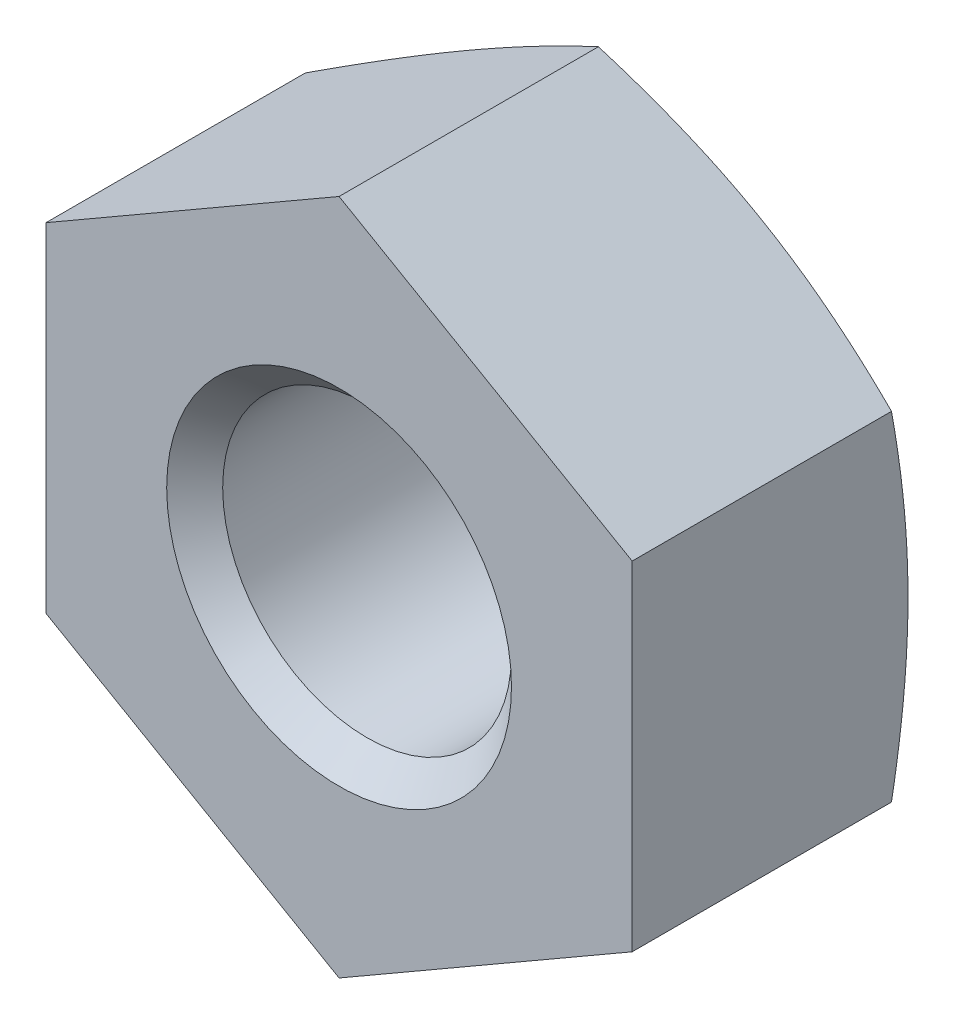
ISO-10303-21;
HEADER;
FILE_DESCRIPTION(('STEP AP214'),'2;1');
FILE_NAME('part.step','',(''),(''),'','','');
FILE_SCHEMA(('AUTOMOTIVE_DESIGN { 1 0 10303 214 1 1 1 1 }'));
ENDSEC;
DATA;
#1=APPLICATION_CONTEXT('core data for automotive mechanical design processes');
#2=APPLICATION_PROTOCOL_DEFINITION('international standard','automotive_design',2000,#1);
#3=PRODUCT_CONTEXT('',#1,'mechanical');
#4=PRODUCT('Part','Part','',(#3));
#5=PRODUCT_RELATED_PRODUCT_CATEGORY('part','',(#4));
#6=PRODUCT_DEFINITION_FORMATION('','',#4);
#7=PRODUCT_DEFINITION_CONTEXT('part definition',#1,'design');
#8=PRODUCT_DEFINITION('design','',#6,#7);
#9=PRODUCT_DEFINITION_SHAPE('','',#8);
#10=(LENGTH_UNIT() NAMED_UNIT(*) SI_UNIT(.MILLI.,.METRE.));
#11=(NAMED_UNIT(*) PLANE_ANGLE_UNIT() SI_UNIT($,.RADIAN.));
#12=(NAMED_UNIT(*) SI_UNIT($,.STERADIAN.) SOLID_ANGLE_UNIT());
#13=UNCERTAINTY_MEASURE_WITH_UNIT(LENGTH_MEASURE(1.E-05),#10,'distance_accuracy_value','');
#14=(GEOMETRIC_REPRESENTATION_CONTEXT(3) GLOBAL_UNCERTAINTY_ASSIGNED_CONTEXT((#13)) GLOBAL_UNIT_ASSIGNED_CONTEXT((#10,
#11,#12)) REPRESENTATION_CONTEXT('',''));
#15=CARTESIAN_POINT('',(0.,0.,0.));
#16=DIRECTION('',(0.,0.,1.));
#17=DIRECTION('',(1.,0.,0.));
#18=AXIS2_PLACEMENT_3D('',#15,#16,#17);
#19=CARTESIAN_POINT('',(0.,0.,0.));
#20=DIRECTION('',(0.,0.,1.));
#21=DIRECTION('',(1.,0.,0.));
#22=AXIS2_PLACEMENT_3D('',#19,#20,#21);
#23=PLANE('',#22);
#24=CARTESIAN_POINT('',(0.,0.,0.));
#25=DIRECTION('',(0.,0.,-1.));
#26=DIRECTION('',(-1.,0.,0.));
#27=AXIS2_PLACEMENT_3D('',#24,#25,#26);
#28=CIRCLE('',#27,4.99999999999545);
#29=CARTESIAN_POINT('',(-4.99999999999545,0.,0.));
#30=VERTEX_POINT('',#29);
#31=EDGE_CURVE('E19',#30,#30,#28,.F.);
#32=ORIENTED_EDGE('',*,*,#31,.T.);
#33=EDGE_LOOP('',(#32));
#34=FACE_BOUND('',#33,.T.);
#35=CARTESIAN_POINT('',(0.,0.,0.));
#36=DIRECTION('',(0.,0.,1.));
#37=DIRECTION('',(0.,-1.,0.));
#38=AXIS2_PLACEMENT_3D('',#35,#36,#37);
#39=CIRCLE('',#38,8.5);
#40=CARTESIAN_POINT('',(-4.25,-7.36121593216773,0.));
#41=VERTEX_POINT('',#40);
#42=CARTESIAN_POINT('',(4.25,-7.36121593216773,0.));
#43=VERTEX_POINT('',#42);
#44=EDGE_CURVE('E91',#41,#43,#39,.T.);
#45=ORIENTED_EDGE('',*,*,#44,.F.);
#46=CARTESIAN_POINT('',(0.,0.,0.));
#47=DIRECTION('',(0.,0.,1.));
#48=DIRECTION('',(1.,0.,0.));
#49=AXIS2_PLACEMENT_3D('',#46,#47,#48);
#50=CIRCLE('',#49,8.5);
#51=CARTESIAN_POINT('',(-8.5,0.,0.));
#52=VERTEX_POINT('',#51);
#53=EDGE_CURVE('E88',#52,#41,#50,.T.);
#54=ORIENTED_EDGE('',*,*,#53,.F.);
#55=CARTESIAN_POINT('',(0.,0.,0.));
#56=DIRECTION('',(0.,0.,1.));
#57=DIRECTION('',(1.,0.,0.));
#58=AXIS2_PLACEMENT_3D('',#55,#56,#57);
#59=CIRCLE('',#58,8.5);
#60=CARTESIAN_POINT('',(-4.25,7.36121593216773,0.));
#61=VERTEX_POINT('',#60);
#62=EDGE_CURVE('E85',#61,#52,#59,.T.);
#63=ORIENTED_EDGE('',*,*,#62,.F.);
#64=CARTESIAN_POINT('',(0.,0.,0.));
#65=DIRECTION('',(0.,0.,1.));
#66=DIRECTION('',(0.,-1.,0.));
#67=AXIS2_PLACEMENT_3D('',#64,#65,#66);
#68=CIRCLE('',#67,8.5);
#69=CARTESIAN_POINT('',(4.25,7.36121593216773,0.));
#70=VERTEX_POINT('',#69);
#71=EDGE_CURVE('E328',#70,#61,#68,.T.);
#72=ORIENTED_EDGE('',*,*,#71,.F.);
#73=CARTESIAN_POINT('',(0.,0.,0.));
#74=DIRECTION('',(0.,0.,1.));
#75=DIRECTION('',(1.,0.,0.));
#76=AXIS2_PLACEMENT_3D('',#73,#74,#75);
#77=CIRCLE('',#76,8.5);
#78=CARTESIAN_POINT('',(8.5,0.,0.));
#79=VERTEX_POINT('',#78);
#80=EDGE_CURVE('E157',#79,#70,#77,.T.);
#81=ORIENTED_EDGE('',*,*,#80,.F.);
#82=CARTESIAN_POINT('',(0.,0.,0.));
#83=DIRECTION('',(0.,0.,1.));
#84=DIRECTION('',(1.,0.,0.));
#85=AXIS2_PLACEMENT_3D('',#82,#83,#84);
#86=CIRCLE('',#85,8.5);
#87=EDGE_CURVE('E331',#43,#79,#86,.T.);
#88=ORIENTED_EDGE('',*,*,#87,.F.);
#89=EDGE_LOOP('',(#45,#54,#63,#72,#81,#88));
#90=FACE_BOUND('',#89,.T.);
#91=ADVANCED_FACE('F16',(#34,#90),#23,.F.);
#92=CARTESIAN_POINT('',(0.,0.,0.));
#93=DIRECTION('',(0.,0.,-1.));
#94=DIRECTION('',(-1.,0.,0.));
#95=AXIS2_PLACEMENT_3D('',#92,#93,#94);
#96=CONICAL_SURFACE('',#95,4.99999999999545,0.785398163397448);
#97=CARTESIAN_POINT('',(0.,0.,0.812));
#98=DIRECTION('',(0.,0.,1.));
#99=DIRECTION('',(1.,0.,0.));
#100=AXIS2_PLACEMENT_3D('',#97,#98,#99);
#101=CIRCLE('',#100,4.188);
#102=CARTESIAN_POINT('',(4.188,0.,0.812));
#103=VERTEX_POINT('',#102);
#104=EDGE_CURVE('E151',#103,#103,#101,.T.);
#105=ORIENTED_EDGE('',*,*,#104,.T.);
#106=EDGE_LOOP('',(#105));
#107=FACE_BOUND('',#106,.T.);
#108=ORIENTED_EDGE('',*,*,#31,.F.);
#109=EDGE_LOOP('',(#108));
#110=FACE_BOUND('',#109,.T.);
#111=ADVANCED_FACE('F142',(#107,#110),#96,.F.);
#112=CARTESIAN_POINT('',(0.,0.,0.481475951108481));
#113=DIRECTION('',(0.,0.,1.));
#114=DIRECTION('',(1.,0.,0.));
#115=AXIS2_PLACEMENT_3D('',#112,#113,#114);
#116=CONICAL_SURFACE('',#115,9.82284430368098,1.22173047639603);
#117=CARTESIAN_POINT('',(-8.5,0.,0.));
#118=CARTESIAN_POINT('',(-8.5,0.206005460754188,-1.72303343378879E-05));
#119=CARTESIAN_POINT('',(-8.5,0.412007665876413,0.00272543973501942));
#120=CARTESIAN_POINT('',(-8.5,0.823857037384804,0.0136034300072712));
#121=CARTESIAN_POINT('',(-8.5,1.02970421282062,0.0217384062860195));
#122=CARTESIAN_POINT('',(-8.5,1.44069803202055,0.0432517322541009));
#123=CARTESIAN_POINT('',(-8.5,1.64584524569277,0.0566192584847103));
#124=CARTESIAN_POINT('',(-8.5,2.05575047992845,0.088360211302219));
#125=CARTESIAN_POINT('',(-8.5,2.26050849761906,0.106733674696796));
#126=CARTESIAN_POINT('',(-8.5,2.87385606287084,0.168918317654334));
#127=CARTESIAN_POINT('',(-8.5,3.28173070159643,0.219805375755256));
#128=CARTESIAN_POINT('',(-8.5,4.09601921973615,0.33775937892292));
#129=CARTESIAN_POINT('',(-8.5,4.50242828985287,0.404859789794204));
#130=CARTESIAN_POINT('',(-8.5,4.90747728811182,0.478604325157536));
#131=B_SPLINE_CURVE_WITH_KNOTS('',3,(#117,#118,#119,#120,#121,#122,#123,#124,#125,#126,#127,
#128,#129,#130),.UNSPECIFIED.,.F.,.F.,(4,2,2,2,2,2,4),(0.,0.617992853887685,1.23594629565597,
1.85262820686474,2.46931465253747,3.70205253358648,4.9373569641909),.UNSPECIFIED.);
#132=CARTESIAN_POINT('',(-8.5,4.90747728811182,0.478604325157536));
#133=VERTEX_POINT('',#132);
#134=EDGE_CURVE('E103',#52,#133,#131,.T.);
#135=ORIENTED_EDGE('',*,*,#134,.T.);
#136=CARTESIAN_POINT('',(-8.5,4.90747728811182,0.478604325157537));
#137=CARTESIAN_POINT('',(-8.14921727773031,5.1100017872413,0.404859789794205));
#138=CARTESIAN_POINT('',(-7.79725669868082,5.31320632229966,0.33775937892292));
#139=CARTESIAN_POINT('',(-7.09206215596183,5.72035058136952,0.219805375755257));
#140=CARTESIAN_POINT('',(-6.73883235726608,5.92428790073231,0.168918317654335));
#141=CARTESIAN_POINT('',(-6.2076577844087,6.2309616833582,0.106733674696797));
#142=CARTESIAN_POINT('',(-6.03033213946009,6.33334069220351,0.0883602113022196));
#143=CARTESIAN_POINT('',(-5.67534379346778,6.53829330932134,0.0566192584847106));
#144=CARTESIAN_POINT('',(-5.49768109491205,6.64086691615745,0.043251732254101));
#145=CARTESIAN_POINT('',(-5.14175000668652,6.84636382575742,0.0217384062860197));
#146=CARTESIAN_POINT('',(-4.96348112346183,6.94928741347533,0.0136034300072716));
#147=CARTESIAN_POINT('',(-4.60680910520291,7.15521209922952,0.0027254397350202));
#148=CARTESIAN_POINT('',(-4.42840596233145,7.25821320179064,-1.72303343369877E-05));
#149=CARTESIAN_POINT('',(-4.25,7.36121593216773,0.));
#150=B_SPLINE_CURVE_WITH_KNOTS('',3,(#136,#137,#138,#139,#140,#141,#142,#143,#144,#145,#146,
#147,#148,#149),.UNSPECIFIED.,.F.,.F.,(4,2,2,2,2,2,4),(0.,1.23530443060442,2.46804231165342,
3.08472875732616,3.70141066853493,4.31936411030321,4.9373569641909),.UNSPECIFIED.);
#151=EDGE_CURVE('E109',#133,#61,#150,.T.);
#152=ORIENTED_EDGE('',*,*,#151,.T.);
#153=ORIENTED_EDGE('',*,*,#62,.T.);
#154=EDGE_LOOP('',(#135,#152,#153));
#155=FACE_BOUND('',#154,.T.);
#156=ADVANCED_FACE('F107',(#155),#116,.T.);
#157=CARTESIAN_POINT('',(0.,0.,0.481475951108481));
#158=DIRECTION('',(0.,0.,1.));
#159=DIRECTION('',(1.,0.,0.));
#160=AXIS2_PLACEMENT_3D('',#157,#158,#159);
#161=CONICAL_SURFACE('',#160,9.82284430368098,1.22173047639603);
#162=CARTESIAN_POINT('',(-4.25,-7.36121593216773,0.));
#163=CARTESIAN_POINT('',(-4.42840596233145,-7.25821320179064,-1.72303343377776E-05));
#164=CARTESIAN_POINT('',(-4.60680910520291,-7.15521209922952,0.0027254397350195));
#165=CARTESIAN_POINT('',(-4.96348112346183,-6.94928741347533,0.013603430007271));
#166=CARTESIAN_POINT('',(-5.14175000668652,-6.84636382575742,0.0217384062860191));
#167=CARTESIAN_POINT('',(-5.49768109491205,-6.64086691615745,0.0432517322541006));
#168=CARTESIAN_POINT('',(-5.67534379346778,-6.53829330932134,0.0566192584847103));
#169=CARTESIAN_POINT('',(-6.03033213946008,-6.33334069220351,0.0883602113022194));
#170=CARTESIAN_POINT('',(-6.2076577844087,-6.2309616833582,0.106733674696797));
#171=CARTESIAN_POINT('',(-6.73883235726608,-5.92428790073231,0.168918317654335));
#172=CARTESIAN_POINT('',(-7.09206215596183,-5.72035058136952,0.219805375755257));
#173=CARTESIAN_POINT('',(-7.79725669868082,-5.31320632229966,0.33775937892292));
#174=CARTESIAN_POINT('',(-8.14921727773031,-5.1100017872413,0.404859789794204));
#175=CARTESIAN_POINT('',(-8.5,-4.90747728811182,0.478604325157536));
#176=B_SPLINE_CURVE_WITH_KNOTS('',3,(#162,#163,#164,#165,#166,#167,#168,#169,#170,#171,#172,
#173,#174,#175),.UNSPECIFIED.,.F.,.F.,(4,2,2,2,2,2,4),(0.,0.617992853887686,1.23594629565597,
1.85262820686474,2.46931465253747,3.70205253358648,4.93735696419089),.UNSPECIFIED.);
#177=CARTESIAN_POINT('',(-8.5,-4.90747728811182,0.478604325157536));
#178=VERTEX_POINT('',#177);
#179=EDGE_CURVE('E99',#41,#178,#176,.T.);
#180=ORIENTED_EDGE('',*,*,#179,.T.);
#181=CARTESIAN_POINT('',(-8.5,-4.90747728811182,0.478604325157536));
#182=CARTESIAN_POINT('',(-8.5,-4.50242828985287,0.404859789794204));
#183=CARTESIAN_POINT('',(-8.5,-4.09601921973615,0.33775937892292));
#184=CARTESIAN_POINT('',(-8.5,-3.28173070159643,0.219805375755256));
#185=CARTESIAN_POINT('',(-8.5,-2.87385606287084,0.168918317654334));
#186=CARTESIAN_POINT('',(-8.5,-2.26050849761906,0.106733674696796));
#187=CARTESIAN_POINT('',(-8.5,-2.05575047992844,0.0883602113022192));
#188=CARTESIAN_POINT('',(-8.5,-1.64584524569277,0.0566192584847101));
#189=CARTESIAN_POINT('',(-8.5,-1.44069803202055,0.0432517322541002));
#190=CARTESIAN_POINT('',(-8.5,-1.02970421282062,0.0217384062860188));
#191=CARTESIAN_POINT('',(-8.5,-0.823857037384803,0.0136034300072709));
#192=CARTESIAN_POINT('',(-8.5,-0.412007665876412,0.00272543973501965));
#193=CARTESIAN_POINT('',(-8.5,-0.206005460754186,-1.72303343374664E-05));
#194=CARTESIAN_POINT('',(-8.5,0.,0.));
#195=B_SPLINE_CURVE_WITH_KNOTS('',3,(#181,#182,#183,#184,#185,#186,#187,#188,#189,#190,#191,
#192,#193,#194),.UNSPECIFIED.,.F.,.F.,(4,2,2,2,2,2,4),(0.,1.23530443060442,2.46804231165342,
3.08472875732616,3.70141066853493,4.31936411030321,4.9373569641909),.UNSPECIFIED.);
#196=EDGE_CURVE('E97',#178,#52,#195,.T.);
#197=ORIENTED_EDGE('',*,*,#196,.T.);
#198=ORIENTED_EDGE('',*,*,#53,.T.);
#199=EDGE_LOOP('',(#180,#197,#198));
#200=FACE_BOUND('',#199,.T.);
#201=ADVANCED_FACE('F98',(#200),#161,.T.);
#202=CARTESIAN_POINT('',(0.,0.,0.481475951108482));
#203=DIRECTION('',(0.,0.,1.));
#204=DIRECTION('',(0.,-1.,0.));
#205=AXIS2_PLACEMENT_3D('',#202,#203,#204);
#206=CONICAL_SURFACE('',#205,9.82284430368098,1.22173047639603);
#207=CARTESIAN_POINT('',(4.25,-7.36121593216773,0.));
#208=CARTESIAN_POINT('',(4.07159403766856,-7.46421866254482,-1.72303343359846E-05));
#209=CARTESIAN_POINT('',(3.8931908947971,-7.56721976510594,0.00272543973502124));
#210=CARTESIAN_POINT('',(3.53651887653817,-7.77314445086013,0.0136034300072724));
#211=CARTESIAN_POINT('',(3.35824999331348,-7.87606803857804,0.0217384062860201));
#212=CARTESIAN_POINT('',(3.00231890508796,-8.08156494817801,0.0432517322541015));
#213=CARTESIAN_POINT('',(2.82465620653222,-8.18413855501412,0.0566192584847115));
#214=CARTESIAN_POINT('',(2.46966786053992,-8.38909117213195,0.0883602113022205));
#215=CARTESIAN_POINT('',(2.2923422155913,-8.49147018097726,0.106733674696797));
#216=CARTESIAN_POINT('',(1.76116764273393,-8.79814396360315,0.168918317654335));
#217=CARTESIAN_POINT('',(1.40793784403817,-9.00208128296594,0.219805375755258));
#218=CARTESIAN_POINT('',(0.702743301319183,-9.4092255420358,0.337759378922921));
#219=CARTESIAN_POINT('',(0.350782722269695,-9.61243007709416,0.404859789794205));
#220=CARTESIAN_POINT('',(0.,-9.81495457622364,0.478604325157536));
#221=B_SPLINE_CURVE_WITH_KNOTS('',3,(#207,#208,#209,#210,#211,#212,#213,#214,#215,#216,#217,
#218,#219,#220),.UNSPECIFIED.,.F.,.F.,(4,2,2,2,2,2,4),(0.,0.617992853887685,1.23594629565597,
1.85262820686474,2.46931465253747,3.70205253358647,4.93735696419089),.UNSPECIFIED.);
#222=CARTESIAN_POINT('',(0.,-9.81495457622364,0.478604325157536));
#223=VERTEX_POINT('',#222);
#224=EDGE_CURVE('E235',#43,#223,#221,.T.);
#225=ORIENTED_EDGE('',*,*,#224,.T.);
#226=CARTESIAN_POINT('',(0.,-9.81495457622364,0.478604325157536));
#227=CARTESIAN_POINT('',(-0.350782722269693,-9.61243007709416,0.404859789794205));
#228=CARTESIAN_POINT('',(-0.702743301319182,-9.4092255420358,0.337759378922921));
#229=CARTESIAN_POINT('',(-1.40793784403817,-9.00208128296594,0.219805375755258));
#230=CARTESIAN_POINT('',(-1.76116764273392,-8.79814396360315,0.168918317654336));
#231=CARTESIAN_POINT('',(-2.2923422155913,-8.49147018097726,0.106733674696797));
#232=CARTESIAN_POINT('',(-2.46966786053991,-8.38909117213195,0.0883602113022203));
#233=CARTESIAN_POINT('',(-2.82465620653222,-8.18413855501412,0.0566192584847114));
#234=CARTESIAN_POINT('',(-3.00231890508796,-8.08156494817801,0.0432517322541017));
#235=CARTESIAN_POINT('',(-3.35824999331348,-7.87606803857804,0.0217384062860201));
#236=CARTESIAN_POINT('',(-3.53651887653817,-7.77314445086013,0.0136034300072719));
#237=CARTESIAN_POINT('',(-3.8931908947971,-7.56721976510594,0.00272543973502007));
#238=CARTESIAN_POINT('',(-4.07159403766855,-7.46421866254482,-1.72303343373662E-05));
#239=CARTESIAN_POINT('',(-4.25,-7.36121593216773,0.));
#240=B_SPLINE_CURVE_WITH_KNOTS('',3,(#226,#227,#228,#229,#230,#231,#232,#233,#234,#235,#236,
#237,#238,#239),.UNSPECIFIED.,.F.,.F.,(4,2,2,2,2,2,4),(0.,1.23530443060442,2.46804231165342,
3.08472875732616,3.70141066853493,4.31936411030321,4.93735696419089),.UNSPECIFIED.);
#241=EDGE_CURVE('E116',#223,#41,#240,.T.);
#242=ORIENTED_EDGE('',*,*,#241,.T.);
#243=ORIENTED_EDGE('',*,*,#44,.T.);
#244=EDGE_LOOP('',(#225,#242,#243));
#245=FACE_BOUND('',#244,.T.);
#246=ADVANCED_FACE('F224',(#245),#206,.T.);
#247=CARTESIAN_POINT('',(0.,0.,0.481475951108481));
#248=DIRECTION('',(0.,0.,1.));
#249=DIRECTION('',(1.,0.,0.));
#250=AXIS2_PLACEMENT_3D('',#247,#248,#249);
#251=CONICAL_SURFACE('',#250,9.82284430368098,1.22173047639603);
#252=CARTESIAN_POINT('',(8.5,0.,0.));
#253=CARTESIAN_POINT('',(8.5,-0.206005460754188,-1.72303343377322E-05));
#254=CARTESIAN_POINT('',(8.5,-0.412007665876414,0.0027254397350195));
#255=CARTESIAN_POINT('',(8.5,-0.823857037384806,0.0136034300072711));
#256=CARTESIAN_POINT('',(8.5,-1.02970421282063,0.0217384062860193));
#257=CARTESIAN_POINT('',(8.5,-1.44069803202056,0.043251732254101));
#258=CARTESIAN_POINT('',(8.5,-1.64584524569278,0.0566192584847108));
#259=CARTESIAN_POINT('',(8.5,-2.05575047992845,0.0883602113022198));
#260=CARTESIAN_POINT('',(8.5,-2.26050849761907,0.106733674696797));
#261=CARTESIAN_POINT('',(8.5,-2.87385606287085,0.168918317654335));
#262=CARTESIAN_POINT('',(8.5,-3.28173070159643,0.219805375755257));
#263=CARTESIAN_POINT('',(8.5,-4.09601921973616,0.337759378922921));
#264=CARTESIAN_POINT('',(8.5,-4.50242828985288,0.404859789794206));
#265=CARTESIAN_POINT('',(8.5,-4.90747728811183,0.478604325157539));
#266=B_SPLINE_CURVE_WITH_KNOTS('',3,(#252,#253,#254,#255,#256,#257,#258,#259,#260,#261,#262,
#263,#264,#265),.UNSPECIFIED.,.F.,.F.,(4,2,2,2,2,2,4),(0.,0.617992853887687,1.23594629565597,
1.85262820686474,2.46931465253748,3.70205253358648,4.93735696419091),.UNSPECIFIED.);
#267=CARTESIAN_POINT('',(8.5,-4.90747728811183,0.478604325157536));
#268=VERTEX_POINT('',#267);
#269=EDGE_CURVE('E215',#79,#268,#266,.T.);
#270=ORIENTED_EDGE('',*,*,#269,.T.);
#271=CARTESIAN_POINT('',(8.5,-4.90747728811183,0.478604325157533));
#272=CARTESIAN_POINT('',(8.14921727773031,-5.1100017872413,0.404859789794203));
#273=CARTESIAN_POINT('',(7.79725669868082,-5.31320632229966,0.33775937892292));
#274=CARTESIAN_POINT('',(7.09206215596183,-5.72035058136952,0.219805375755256));
#275=CARTESIAN_POINT('',(6.73883235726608,-5.92428790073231,0.168918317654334));
#276=CARTESIAN_POINT('',(6.2076577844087,-6.2309616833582,0.106733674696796));
#277=CARTESIAN_POINT('',(6.03033213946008,-6.33334069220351,0.0883602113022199));
#278=CARTESIAN_POINT('',(5.67534379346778,-6.53829330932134,0.056619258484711));
#279=CARTESIAN_POINT('',(5.49768109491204,-6.64086691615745,0.0432517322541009));
#280=CARTESIAN_POINT('',(5.14175000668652,-6.84636382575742,0.0217384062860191));
#281=CARTESIAN_POINT('',(4.96348112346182,-6.94928741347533,0.0136034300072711));
#282=CARTESIAN_POINT('',(4.6068091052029,-7.15521209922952,0.00272543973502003));
#283=CARTESIAN_POINT('',(4.42840596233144,-7.25821320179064,-1.72303343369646E-05));
#284=CARTESIAN_POINT('',(4.25,-7.36121593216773,0.));
#285=B_SPLINE_CURVE_WITH_KNOTS('',3,(#271,#272,#273,#274,#275,#276,#277,#278,#279,#280,#281,
#282,#283,#284),.UNSPECIFIED.,.F.,.F.,(4,2,2,2,2,2,4),(0.,1.23530443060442,2.46804231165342,
3.08472875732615,3.70141066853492,4.31936411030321,4.93735696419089),.UNSPECIFIED.);
#286=EDGE_CURVE('E229',#268,#43,#285,.T.);
#287=ORIENTED_EDGE('',*,*,#286,.T.);
#288=ORIENTED_EDGE('',*,*,#87,.T.);
#289=EDGE_LOOP('',(#270,#287,#288));
#290=FACE_BOUND('',#289,.T.);
#291=ADVANCED_FACE('F221',(#290),#251,.T.);
#292=CARTESIAN_POINT('',(0.,0.,0.481475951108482));
#293=DIRECTION('',(0.,0.,1.));
#294=DIRECTION('',(0.,-1.,0.));
#295=AXIS2_PLACEMENT_3D('',#292,#293,#294);
#296=CONICAL_SURFACE('',#295,9.82284430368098,1.22173047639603);
#297=CARTESIAN_POINT('',(0.,9.81495457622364,0.478604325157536));
#298=CARTESIAN_POINT('',(0.350782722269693,9.61243007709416,0.404859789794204));
#299=CARTESIAN_POINT('',(0.702743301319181,9.4092255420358,0.33775937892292));
#300=CARTESIAN_POINT('',(1.40793784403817,9.00208128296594,0.219805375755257));
#301=CARTESIAN_POINT('',(1.76116764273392,8.79814396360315,0.168918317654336));
#302=CARTESIAN_POINT('',(2.2923422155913,8.49147018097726,0.106733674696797));
#303=CARTESIAN_POINT('',(2.46966786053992,8.38909117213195,0.0883602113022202));
#304=CARTESIAN_POINT('',(2.82465620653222,8.18413855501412,0.0566192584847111));
#305=CARTESIAN_POINT('',(3.00231890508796,8.081564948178,0.0432517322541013));
#306=CARTESIAN_POINT('',(3.35824999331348,7.87606803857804,0.0217384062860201));
#307=CARTESIAN_POINT('',(3.53651887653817,7.77314445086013,0.0136034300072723));
#308=CARTESIAN_POINT('',(3.8931908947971,7.56721976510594,0.0027254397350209));
#309=CARTESIAN_POINT('',(4.07159403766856,7.46421866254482,-1.72303343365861E-05));
#310=CARTESIAN_POINT('',(4.25,7.36121593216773,0.));
#311=B_SPLINE_CURVE_WITH_KNOTS('',3,(#297,#298,#299,#300,#301,#302,#303,#304,#305,#306,#307,
#308,#309,#310),.UNSPECIFIED.,.F.,.F.,(4,2,2,2,2,2,4),(0.,1.23530443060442,2.46804231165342,
3.08472875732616,3.70141066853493,4.31936411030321,4.9373569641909),.UNSPECIFIED.);
#312=CARTESIAN_POINT('',(0.,9.81495457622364,0.478604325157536));
#313=VERTEX_POINT('',#312);
#314=EDGE_CURVE('E194',#313,#70,#311,.T.);
#315=ORIENTED_EDGE('',*,*,#314,.T.);
#316=ORIENTED_EDGE('',*,*,#71,.T.);
#317=CARTESIAN_POINT('',(-4.25,7.36121593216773,0.));
#318=CARTESIAN_POINT('',(-4.07159403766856,7.46421866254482,-1.72303343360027E-05));
#319=CARTESIAN_POINT('',(-3.8931908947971,7.56721976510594,0.0027254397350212));
#320=CARTESIAN_POINT('',(-3.53651887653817,7.77314445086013,0.0136034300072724));
#321=CARTESIAN_POINT('',(-3.35824999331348,7.87606803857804,0.0217384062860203));
#322=CARTESIAN_POINT('',(-3.00231890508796,8.08156494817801,0.0432517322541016));
#323=CARTESIAN_POINT('',(-2.82465620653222,8.18413855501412,0.0566192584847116));
#324=CARTESIAN_POINT('',(-2.46966786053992,8.38909117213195,0.0883602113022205));
#325=CARTESIAN_POINT('',(-2.2923422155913,8.49147018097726,0.106733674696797));
#326=CARTESIAN_POINT('',(-1.76116764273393,8.79814396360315,0.168918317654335));
#327=CARTESIAN_POINT('',(-1.40793784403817,9.00208128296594,0.219805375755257));
#328=CARTESIAN_POINT('',(-0.702743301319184,9.4092255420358,0.337759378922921));
#329=CARTESIAN_POINT('',(-0.350782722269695,9.61243007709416,0.404859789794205));
#330=CARTESIAN_POINT('',(0.,9.81495457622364,0.478604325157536));
#331=B_SPLINE_CURVE_WITH_KNOTS('',3,(#317,#318,#319,#320,#321,#322,#323,#324,#325,#326,#327,
#328,#329,#330),.UNSPECIFIED.,.F.,.F.,(4,2,2,2,2,2,4),(0.,0.617992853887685,1.23594629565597,
1.85262820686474,2.46931465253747,3.70205253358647,4.93735696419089),.UNSPECIFIED.);
#332=EDGE_CURVE('E104',#61,#313,#331,.T.);
#333=ORIENTED_EDGE('',*,*,#332,.T.);
#334=EDGE_LOOP('',(#315,#316,#333));
#335=FACE_BOUND('',#334,.T.);
#336=ADVANCED_FACE('F172',(#335),#296,.T.);
#337=CARTESIAN_POINT('',(0.,0.,0.481475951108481));
#338=DIRECTION('',(0.,0.,1.));
#339=DIRECTION('',(1.,0.,0.));
#340=AXIS2_PLACEMENT_3D('',#337,#338,#339);
#341=CONICAL_SURFACE('',#340,9.82284430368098,1.22173047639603);
#342=CARTESIAN_POINT('',(4.25,7.36121593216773,0.));
#343=CARTESIAN_POINT('',(4.42840596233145,7.25821320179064,-1.72303343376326E-05));
#344=CARTESIAN_POINT('',(4.60680910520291,7.15521209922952,0.00272543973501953));
#345=CARTESIAN_POINT('',(4.96348112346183,6.94928741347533,0.013603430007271));
#346=CARTESIAN_POINT('',(5.14175000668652,6.84636382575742,0.0217384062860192));
#347=CARTESIAN_POINT('',(5.49768109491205,6.64086691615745,0.0432517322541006));
#348=CARTESIAN_POINT('',(5.67534379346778,6.53829330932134,0.0566192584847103));
#349=CARTESIAN_POINT('',(6.03033213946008,6.33334069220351,0.0883602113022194));
#350=CARTESIAN_POINT('',(6.2076577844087,6.2309616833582,0.106733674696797));
#351=CARTESIAN_POINT('',(6.73883235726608,5.92428790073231,0.168918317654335));
#352=CARTESIAN_POINT('',(7.09206215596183,5.72035058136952,0.219805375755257));
#353=CARTESIAN_POINT('',(7.79725669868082,5.31320632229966,0.33775937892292));
#354=CARTESIAN_POINT('',(8.14921727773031,5.1100017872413,0.404859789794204));
#355=CARTESIAN_POINT('',(8.5,4.90747728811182,0.478604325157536));
#356=B_SPLINE_CURVE_WITH_KNOTS('',3,(#342,#343,#344,#345,#346,#347,#348,#349,#350,#351,#352,
#353,#354,#355),.UNSPECIFIED.,.F.,.F.,(4,2,2,2,2,2,4),(0.,0.617992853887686,1.23594629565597,
1.85262820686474,2.46931465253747,3.70205253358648,4.93735696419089),.UNSPECIFIED.);
#357=CARTESIAN_POINT('',(8.5,4.90747728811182,0.478604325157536));
#358=VERTEX_POINT('',#357);
#359=EDGE_CURVE('E187',#70,#358,#356,.T.);
#360=ORIENTED_EDGE('',*,*,#359,.T.);
#361=CARTESIAN_POINT('',(8.5,4.90747728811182,0.478604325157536));
#362=CARTESIAN_POINT('',(8.5,4.50242828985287,0.404859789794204));
#363=CARTESIAN_POINT('',(8.5,4.09601921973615,0.33775937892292));
#364=CARTESIAN_POINT('',(8.5,3.28173070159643,0.219805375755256));
#365=CARTESIAN_POINT('',(8.5,2.87385606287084,0.168918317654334));
#366=CARTESIAN_POINT('',(8.5,2.26050849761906,0.106733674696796));
#367=CARTESIAN_POINT('',(8.5,2.05575047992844,0.0883602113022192));
#368=CARTESIAN_POINT('',(8.5,1.64584524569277,0.0566192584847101));
#369=CARTESIAN_POINT('',(8.5,1.44069803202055,0.0432517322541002));
#370=CARTESIAN_POINT('',(8.5,1.02970421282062,0.0217384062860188));
#371=CARTESIAN_POINT('',(8.5,0.823857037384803,0.0136034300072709));
#372=CARTESIAN_POINT('',(8.5,0.412007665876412,0.00272543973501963));
#373=CARTESIAN_POINT('',(8.5,0.206005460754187,-1.72303343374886E-05));
#374=CARTESIAN_POINT('',(8.5,0.,0.));
#375=B_SPLINE_CURVE_WITH_KNOTS('',3,(#361,#362,#363,#364,#365,#366,#367,#368,#369,#370,#371,
#372,#373,#374),.UNSPECIFIED.,.F.,.F.,(4,2,2,2,2,2,4),(0.,1.23530443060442,2.46804231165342,
3.08472875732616,3.70141066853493,4.31936411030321,4.9373569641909),.UNSPECIFIED.);
#376=EDGE_CURVE('E178',#358,#79,#375,.T.);
#377=ORIENTED_EDGE('',*,*,#376,.T.);
#378=ORIENTED_EDGE('',*,*,#80,.T.);
#379=EDGE_LOOP('',(#360,#377,#378));
#380=FACE_BOUND('',#379,.T.);
#381=ADVANCED_FACE('F168',(#380),#341,.T.);
#382=CARTESIAN_POINT('',(0.,0.,0.));
#383=DIRECTION('',(0.,0.,1.));
#384=DIRECTION('',(1.,0.,0.));
#385=AXIS2_PLACEMENT_3D('',#382,#383,#384);
#386=CYLINDRICAL_SURFACE('',#385,4.188);
#387=CARTESIAN_POINT('',(0.,0.,7.18799999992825));
#388=DIRECTION('',(0.,0.,1.));
#389=DIRECTION('',(1.,0.,0.));
#390=AXIS2_PLACEMENT_3D('',#387,#388,#389);
#391=CIRCLE('',#390,4.1879999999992);
#392=CARTESIAN_POINT('',(4.1879999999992,0.,7.18799999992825));
#393=VERTEX_POINT('',#392);
#394=EDGE_CURVE('E288',#393,#393,#391,.T.);
#395=ORIENTED_EDGE('',*,*,#394,.T.);
#396=EDGE_LOOP('',(#395));
#397=FACE_BOUND('',#396,.T.);
#398=ORIENTED_EDGE('',*,*,#104,.F.);
#399=EDGE_LOOP('',(#398));
#400=FACE_BOUND('',#399,.T.);
#401=ADVANCED_FACE('F163',(#397,#400),#386,.F.);
#402=CARTESIAN_POINT('',(0.,9.81495457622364,8.));
#403=DIRECTION('',(0.5,-0.866025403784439,0.));
#404=DIRECTION('',(0.866025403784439,0.5,0.));
#405=AXIS2_PLACEMENT_3D('',#402,#403,#404);
#406=PLANE('',#405);
#407=ORIENTED_EDGE('',*,*,#332,.F.);
#408=ORIENTED_EDGE('',*,*,#151,.F.);
#409=DIRECTION('',(0.,0.,-1.));
#410=VECTOR('',#409,1.);
#411=CARTESIAN_POINT('',(-8.5,4.90747728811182,8.));
#412=LINE('',#411,#410);
#413=CARTESIAN_POINT('',(-8.5,4.90747728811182,8.));
#414=VERTEX_POINT('',#413);
#415=EDGE_CURVE('E114',#133,#414,#412,.F.);
#416=ORIENTED_EDGE('',*,*,#415,.T.);
#417=DIRECTION('',(-0.866025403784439,-0.5,0.));
#418=VECTOR('',#417,1.);
#419=CARTESIAN_POINT('',(0.,9.81495457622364,8.));
#420=LINE('',#419,#418);
#421=CARTESIAN_POINT('',(0.,9.81495457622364,8.));
#422=VERTEX_POINT('',#421);
#423=EDGE_CURVE('E285',#422,#414,#420,.T.);
#424=ORIENTED_EDGE('',*,*,#423,.F.);
#425=DIRECTION('',(0.,0.,1.));
#426=VECTOR('',#425,1.);
#427=CARTESIAN_POINT('',(0.,9.81495457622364,8.));
#428=LINE('',#427,#426);
#429=EDGE_CURVE('E307',#422,#313,#428,.F.);
#430=ORIENTED_EDGE('',*,*,#429,.T.);
#431=EDGE_LOOP('',(#407,#408,#416,#424,#430));
#432=FACE_BOUND('',#431,.T.);
#433=ADVANCED_FACE('F159',(#432),#406,.F.);
#434=CARTESIAN_POINT('',(-8.5,4.90747728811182,8.));
#435=DIRECTION('',(1.,0.,0.));
#436=DIRECTION('',(0.,0.,-1.));
#437=AXIS2_PLACEMENT_3D('',#434,#435,#436);
#438=PLANE('',#437);
#439=ORIENTED_EDGE('',*,*,#134,.F.);
#440=ORIENTED_EDGE('',*,*,#196,.F.);
#441=DIRECTION('',(0.,0.,1.));
#442=VECTOR('',#441,1.);
#443=CARTESIAN_POINT('',(-8.5,-4.90747728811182,8.));
#444=LINE('',#443,#442);
#445=CARTESIAN_POINT('',(-8.5,-4.90747728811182,8.));
#446=VERTEX_POINT('',#445);
#447=EDGE_CURVE('E236',#178,#446,#444,.T.);
#448=ORIENTED_EDGE('',*,*,#447,.T.);
#449=DIRECTION('',(0.,1.,0.));
#450=VECTOR('',#449,1.);
#451=CARTESIAN_POINT('',(-8.5,0.,8.));
#452=LINE('',#451,#450);
#453=EDGE_CURVE('E287',#414,#446,#452,.F.);
#454=ORIENTED_EDGE('',*,*,#453,.F.);
#455=ORIENTED_EDGE('',*,*,#415,.F.);
#456=EDGE_LOOP('',(#439,#440,#448,#454,#455));
#457=FACE_BOUND('',#456,.T.);
#458=ADVANCED_FACE('F112',(#457),#438,.F.);
#459=CARTESIAN_POINT('',(-8.5,-4.90747728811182,8.));
#460=DIRECTION('',(0.5,0.866025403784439,0.));
#461=DIRECTION('',(-0.866025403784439,0.5,0.));
#462=AXIS2_PLACEMENT_3D('',#459,#460,#461);
#463=PLANE('',#462);
#464=ORIENTED_EDGE('',*,*,#179,.F.);
#465=ORIENTED_EDGE('',*,*,#241,.F.);
#466=DIRECTION('',(0.,0.,1.));
#467=VECTOR('',#466,1.);
#468=CARTESIAN_POINT('',(0.,-9.81495457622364,8.));
#469=LINE('',#468,#467);
#470=CARTESIAN_POINT('',(0.,-9.81495457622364,8.));
#471=VERTEX_POINT('',#470);
#472=EDGE_CURVE('E302',#223,#471,#469,.T.);
#473=ORIENTED_EDGE('',*,*,#472,.T.);
#474=DIRECTION('',(0.866025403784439,-0.5,0.));
#475=VECTOR('',#474,1.);
#476=CARTESIAN_POINT('',(-8.5,-4.90747728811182,8.));
#477=LINE('',#476,#475);
#478=EDGE_CURVE('E278',#446,#471,#477,.T.);
#479=ORIENTED_EDGE('',*,*,#478,.F.);
#480=ORIENTED_EDGE('',*,*,#447,.F.);
#481=EDGE_LOOP('',(#464,#465,#473,#479,#480));
#482=FACE_BOUND('',#481,.T.);
#483=ADVANCED_FACE('F245',(#482),#463,.F.);
#484=CARTESIAN_POINT('',(0.,-9.81495457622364,8.));
#485=DIRECTION('',(-0.5,0.866025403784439,0.));
#486=DIRECTION('',(-0.866025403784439,-0.5,0.));
#487=AXIS2_PLACEMENT_3D('',#484,#485,#486);
#488=PLANE('',#487);
#489=ORIENTED_EDGE('',*,*,#224,.F.);
#490=ORIENTED_EDGE('',*,*,#286,.F.);
#491=DIRECTION('',(0.,0.,1.));
#492=VECTOR('',#491,1.);
#493=CARTESIAN_POINT('',(8.5,-4.90747728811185,8.));
#494=LINE('',#493,#492);
#495=CARTESIAN_POINT('',(8.5,-4.90747728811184,8.));
#496=VERTEX_POINT('',#495);
#497=EDGE_CURVE('E220',#268,#496,#494,.T.);
#498=ORIENTED_EDGE('',*,*,#497,.T.);
#499=DIRECTION('',(0.866025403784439,0.5,0.));
#500=VECTOR('',#499,1.);
#501=CARTESIAN_POINT('',(0.,-9.81495457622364,8.));
#502=LINE('',#501,#500);
#503=EDGE_CURVE('E274',#471,#496,#502,.T.);
#504=ORIENTED_EDGE('',*,*,#503,.F.);
#505=ORIENTED_EDGE('',*,*,#472,.F.);
#506=EDGE_LOOP('',(#489,#490,#498,#504,#505));
#507=FACE_BOUND('',#506,.T.);
#508=ADVANCED_FACE('F212',(#507),#488,.F.);
#509=CARTESIAN_POINT('',(8.5,-4.90747728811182,8.));
#510=DIRECTION('',(-1.,0.,0.));
#511=DIRECTION('',(0.,0.,1.));
#512=AXIS2_PLACEMENT_3D('',#509,#510,#511);
#513=PLANE('',#512);
#514=ORIENTED_EDGE('',*,*,#269,.F.);
#515=ORIENTED_EDGE('',*,*,#376,.F.);
#516=DIRECTION('',(0.,0.,1.));
#517=VECTOR('',#516,1.);
#518=CARTESIAN_POINT('',(8.5,4.90747728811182,8.));
#519=LINE('',#518,#517);
#520=CARTESIAN_POINT('',(8.5,4.90747728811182,8.));
#521=VERTEX_POINT('',#520);
#522=EDGE_CURVE('E34',#358,#521,#519,.T.);
#523=ORIENTED_EDGE('',*,*,#522,.T.);
#524=DIRECTION('',(0.,1.,0.));
#525=VECTOR('',#524,1.);
#526=CARTESIAN_POINT('',(8.5,0.,8.));
#527=LINE('',#526,#525);
#528=EDGE_CURVE('E270',#496,#521,#527,.T.);
#529=ORIENTED_EDGE('',*,*,#528,.F.);
#530=ORIENTED_EDGE('',*,*,#497,.F.);
#531=EDGE_LOOP('',(#514,#515,#523,#529,#530));
#532=FACE_BOUND('',#531,.T.);
#533=ADVANCED_FACE('F205',(#532),#513,.F.);
#534=CARTESIAN_POINT('',(8.5,4.90747728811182,8.));
#535=DIRECTION('',(-0.5,-0.866025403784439,0.));
#536=DIRECTION('',(0.866025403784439,-0.5,0.));
#537=AXIS2_PLACEMENT_3D('',#534,#535,#536);
#538=PLANE('',#537);
#539=ORIENTED_EDGE('',*,*,#359,.F.);
#540=ORIENTED_EDGE('',*,*,#314,.F.);
#541=ORIENTED_EDGE('',*,*,#429,.F.);
#542=DIRECTION('',(-0.866025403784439,0.5,0.));
#543=VECTOR('',#542,1.);
#544=CARTESIAN_POINT('',(8.5,4.90747728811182,8.));
#545=LINE('',#544,#543);
#546=EDGE_CURVE('E25',#521,#422,#545,.T.);
#547=ORIENTED_EDGE('',*,*,#546,.F.);
#548=ORIENTED_EDGE('',*,*,#522,.F.);
#549=EDGE_LOOP('',(#539,#540,#541,#547,#548));
#550=FACE_BOUND('',#549,.T.);
#551=ADVANCED_FACE('F200',(#550),#538,.F.);
#552=CARTESIAN_POINT('',(0.,0.,7.99999999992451));
#553=DIRECTION('',(0.,0.,1.));
#554=DIRECTION('',(1.,0.,0.));
#555=AXIS2_PLACEMENT_3D('',#552,#553,#554);
#556=CONICAL_SURFACE('',#555,4.99999999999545,0.785398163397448);
#557=CARTESIAN_POINT('',(0.,0.,7.99999999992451));
#558=DIRECTION('',(0.,0.,1.));
#559=DIRECTION('',(1.,0.,0.));
#560=AXIS2_PLACEMENT_3D('',#557,#558,#559);
#561=CIRCLE('',#560,4.99999999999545);
#562=CARTESIAN_POINT('',(4.99999999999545,0.,7.99999999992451));
#563=VERTEX_POINT('',#562);
#564=EDGE_CURVE('E11',#563,#563,#561,.F.);
#565=ORIENTED_EDGE('',*,*,#564,.F.);
#566=EDGE_LOOP('',(#565));
#567=FACE_BOUND('',#566,.T.);
#568=ORIENTED_EDGE('',*,*,#394,.F.);
#569=EDGE_LOOP('',(#568));
#570=FACE_BOUND('',#569,.T.);
#571=ADVANCED_FACE('F204',(#567,#570),#556,.F.);
#572=CARTESIAN_POINT('',(0.,0.,8.));
#573=DIRECTION('',(0.,0.,1.));
#574=DIRECTION('',(1.,0.,0.));
#575=AXIS2_PLACEMENT_3D('',#572,#573,#574);
#576=PLANE('',#575);
#577=ORIENTED_EDGE('',*,*,#564,.T.);
#578=EDGE_LOOP('',(#577));
#579=FACE_BOUND('',#578,.T.);
#580=ORIENTED_EDGE('',*,*,#528,.T.);
#581=ORIENTED_EDGE('',*,*,#546,.T.);
#582=ORIENTED_EDGE('',*,*,#423,.T.);
#583=ORIENTED_EDGE('',*,*,#453,.T.);
#584=ORIENTED_EDGE('',*,*,#478,.T.);
#585=ORIENTED_EDGE('',*,*,#503,.T.);
#586=EDGE_LOOP('',(#580,#581,#582,#583,#584,#585));
#587=FACE_BOUND('',#586,.T.);
#588=ADVANCED_FACE('F257',(#579,#587),#576,.T.);
#589=CLOSED_SHELL('',(#91,#111,#156,#201,#246,#291,#336,#381,#401,#433,#458,#483,#508,#533,#551,
#571,#588));
#590=MANIFOLD_SOLID_BREP('B1',#589);
#591=ADVANCED_BREP_SHAPE_REPRESENTATION('',(#18,#590),#14);
#592=SHAPE_DEFINITION_REPRESENTATION(#9,#591);
ENDSEC;
END-ISO-10303-21;
